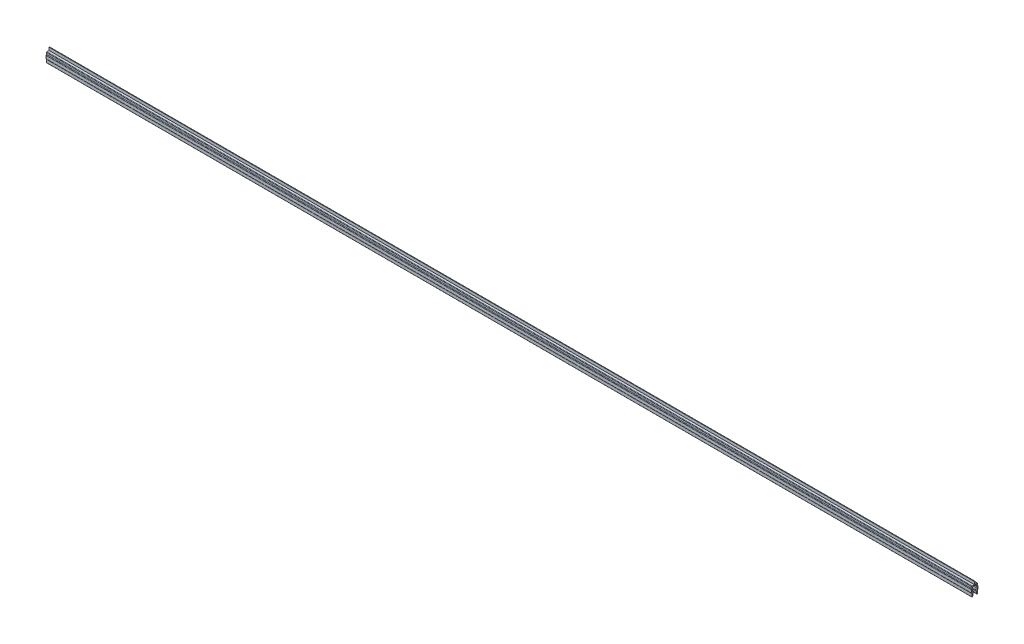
from build123d import *

# Parameters (mm, degrees)
EXTRUDE_1_DEPTH = 1000


with BuildPart() as part:
    # Sketch 1 → Extrude 1 (new body)
    with BuildSketch(Plane(origin=(0, 0, 0), x_dir=(0, 0, -1), z_dir=(1, 0, 0))):
        with BuildLine():
            Line((-0.3, 0), (-0.3, 3))
            Line((-0.3, 3), (0.3, 3))
            Line((0.3, 3), (0.3, 0))
            Line((0.3, 0), (2.616424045, 0))
            ThreePointArc((2.616424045, 0), (2.969977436, -0.146446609), (3.116424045, -0.5))
            Line((3.116424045, -0.5), (3.116424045, -2.208060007))
            ThreePointArc((3.116424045, -2.208060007), (3.183411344, -2.458060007), (3.366424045, -2.641072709))
            ThreePointArc((3.366424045, -2.641072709), (3.549436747, -2.824085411), (3.616424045, -3.074085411))
            Line((3.616424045, -3.074085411), (3.616424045, -5.996639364))
            ThreePointArc((3.616424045, -5.996639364), (3.549436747, -6.246639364), (3.366424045, -6.429652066))
            ThreePointArc((3.366424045, -6.429652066), (3.110206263, -6.685869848), (3.016424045, -7.035869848))
            Line((3.016424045, -7.035869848), (3.016424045, -10.049390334))
            ThreePointArc((3.016424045, -10.049390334), (2.92855608, -10.261522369), (2.716424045, -10.349390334))
            Line((2.716424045, -10.349390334), (2.516424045, -10.349390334))
            Line((2.516424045, -10.349390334), (2.016424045, -9.483364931))
            Line((2.016424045, -9.483364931), (2.016424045, -7.415484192))
            ThreePointArc((2.016424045, -7.415484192), (1.969577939, -7.204175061), (1.83781785, -7.03246197))
            Line((1.83781785, -7.03246197), (0.896638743, -6.242718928))
            ThreePointArc((0.896638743, -6.242718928), (0.837257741, -6.021106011), (1.025196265, -5.88951004))
            Line((1.025196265, -5.88951004), (1.816424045, -5.88951004))
            ThreePointArc((1.816424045, -5.88951004), (2.38210947, -5.655195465), (2.616424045, -5.08951004))
            Line((2.616424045, -5.08951004), (2.616424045, -3.639601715))
            ThreePointArc((2.616424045, -3.639601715), (2.549436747, -3.389601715), (2.366424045, -3.206589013))
            ThreePointArc((2.366424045, -3.206589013), (2.183411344, -3.023576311), (2.116424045, -2.773576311))
            Line((2.116424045, -2.773576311), (2.116424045, -1.5))
            ThreePointArc((2.116424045, -1.5), (1.969977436, -1.146446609), (1.616424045, -1))
            Line((1.616424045, -1), (-1.616424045, -1))
            ThreePointArc((-1.616424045, -1), (-1.969977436, -1.146446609), (-2.116424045, -1.5))
            Line((-2.116424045, -1.5), (-2.116424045, -2.773576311))
            ThreePointArc((-2.116424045, -2.773576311), (-2.183411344, -3.023576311), (-2.366424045, -3.206589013))
            ThreePointArc((-2.366424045, -3.206589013), (-2.549436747, -3.389601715), (-2.616424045, -3.639601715))
            Line((-2.616424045, -3.639601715), (-2.616424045, -5.08951004))
            ThreePointArc((-2.616424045, -5.08951004), (-2.38210947, -5.655195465), (-1.816424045, -5.88951004))
            Line((-1.816424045, -5.88951004), (-1.025196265, -5.88951004))
            ThreePointArc((-1.025196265, -5.88951004), (-0.837257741, -6.021106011), (-0.896638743, -6.242718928))
            Line((-0.896638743, -6.242718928), (-1.83781785, -7.03246197))
            ThreePointArc((-1.83781785, -7.03246197), (-1.969577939, -7.204175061), (-2.016424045, -7.415484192))
            Line((-2.016424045, -7.415484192), (-2.016424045, -9.483364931))
            Line((-2.016424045, -9.483364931), (-2.516424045, -10.349390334))
            Line((-2.516424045, -10.349390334), (-2.716424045, -10.349390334))
            ThreePointArc((-2.716424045, -10.349390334), (-2.92855608, -10.261522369), (-3.016424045, -10.049390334))
            Line((-3.016424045, -10.049390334), (-3.016424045, -7.035869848))
            ThreePointArc((-3.016424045, -7.035869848), (-3.110206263, -6.685869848), (-3.366424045, -6.429652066))
            ThreePointArc((-3.366424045, -6.429652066), (-3.549436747, -6.246639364), (-3.616424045, -5.996639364))
            Line((-3.616424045, -5.996639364), (-3.616424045, -3.074085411))
            ThreePointArc((-3.616424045, -3.074085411), (-3.565782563, -2.854820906), (-3.424116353, -2.67997192))
            ThreePointArc((-3.424116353, -2.67997192), (-3.197450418, -2.400213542), (-3.116424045, -2.049390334))
            Line((-3.116424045, -2.049390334), (-3.116424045, -0.5))
            ThreePointArc((-3.116424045, -0.5), (-2.969977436, -0.146446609), (-2.616424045, 0))
            Line((-2.616424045, 0), (-0.3, 0))
        make_face()
    extrude(amount=EXTRUDE_1_DEPTH)


solid = part.part
